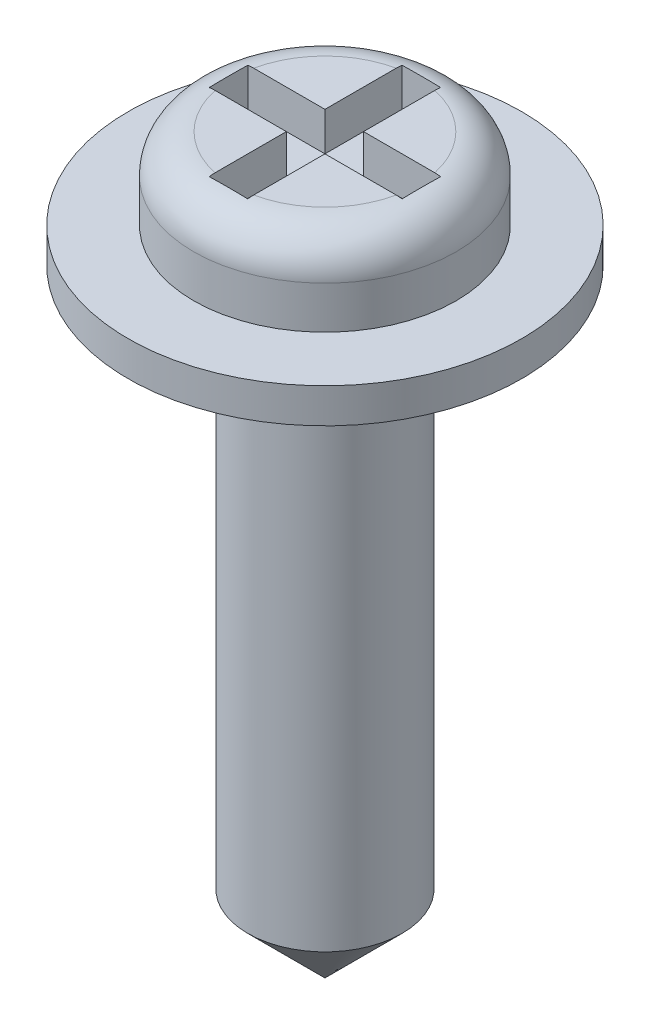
from build123d import *

# Parameters (mm, degrees)
CONG_1_R                = 0.5
ENL_V_MAT_EXTRU_1_DEPTH = 0.5


with BuildPart() as part:
    # Esquisse1 → R_volution1 (revolve)
    with BuildSketch(Plane.XY, mode=Mode.PRIVATE) as r_volution1_sk:
        Polygon((-1, 0), (-1, -7), (0, -8), (0, 1.5), (-1.7, 1.5), (-1.7, 0.45), (-2.55, 0.45), (-2.55, 0), align=None)
    revolve(r_volution1_sk.sketch.rotate(Axis((0, 0, 0), (0, 1, 0)), 270), axis=Axis((0, 0, 0), (0, 1, 0)))

    # Cong_1
    cong_1_edges = [part.edges().sort_by_distance(p)[0] for p in [
        (0, 1.5, 1.7),
    ]]
    fillet(cong_1_edges, radius=CONG_1_R)

    # Esquisse2 → Enl_v. mat.-Extru.1 (cut)
    with BuildSketch(Plane(origin=(0, 1.5, 0), x_dir=(1, 0, 0), z_dir=(0, 1, 0))):
        Polygon((-1.25, 0.25), (-0.25, 0.25), (-0.25, 1.25), (0.25, 1.25), (0.25, 0.25), (1.25, 0.25), (1.25, -0.25), (0.25, -0.25), (0.25, -1.25), (-0.25, -1.25), (-0.25, -0.25), (-1.25, -0.25), align=None)
    extrude(amount=-ENL_V_MAT_EXTRU_1_DEPTH, mode=Mode.SUBTRACT)


solid = part.part
